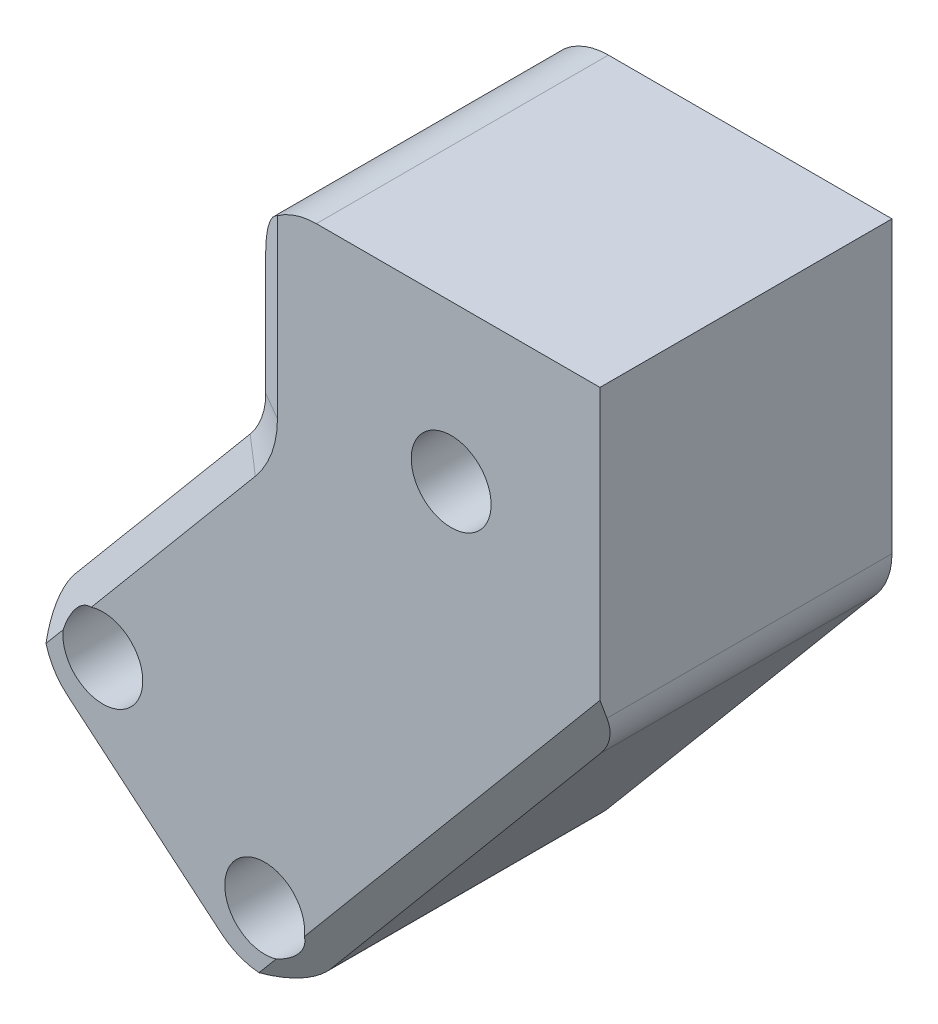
ISO-10303-21;
HEADER;
FILE_DESCRIPTION(('STEP AP214'),'2;1');
FILE_NAME('part.step','',(''),(''),'','','');
FILE_SCHEMA(('AUTOMOTIVE_DESIGN { 1 0 10303 214 1 1 1 1 }'));
ENDSEC;
DATA;
#1=APPLICATION_CONTEXT('core data for automotive mechanical design processes');
#2=APPLICATION_PROTOCOL_DEFINITION('international standard','automotive_design',2000,#1);
#3=PRODUCT_CONTEXT('',#1,'mechanical');
#4=PRODUCT('Part','Part','',(#3));
#5=PRODUCT_RELATED_PRODUCT_CATEGORY('part','',(#4));
#6=PRODUCT_DEFINITION_FORMATION('','',#4);
#7=PRODUCT_DEFINITION_CONTEXT('part definition',#1,'design');
#8=PRODUCT_DEFINITION('design','',#6,#7);
#9=PRODUCT_DEFINITION_SHAPE('','',#8);
#10=(LENGTH_UNIT() NAMED_UNIT(*) SI_UNIT(.MILLI.,.METRE.));
#11=(NAMED_UNIT(*) PLANE_ANGLE_UNIT() SI_UNIT($,.RADIAN.));
#12=(NAMED_UNIT(*) SI_UNIT($,.STERADIAN.) SOLID_ANGLE_UNIT());
#13=UNCERTAINTY_MEASURE_WITH_UNIT(LENGTH_MEASURE(1.E-05),#10,'distance_accuracy_value','');
#14=(GEOMETRIC_REPRESENTATION_CONTEXT(3) GLOBAL_UNCERTAINTY_ASSIGNED_CONTEXT((#13)) GLOBAL_UNIT_ASSIGNED_CONTEXT((#10,
#11,#12)) REPRESENTATION_CONTEXT('',''));
#15=CARTESIAN_POINT('',(0.,0.,0.));
#16=DIRECTION('',(0.,0.,1.));
#17=DIRECTION('',(1.,0.,0.));
#18=AXIS2_PLACEMENT_3D('',#15,#16,#17);
#19=CARTESIAN_POINT('',(-577.716152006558,-20.8198728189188,-31.75));
#20=DIRECTION('',(0.,0.,-1.));
#21=DIRECTION('',(-1.,0.,0.));
#22=AXIS2_PLACEMENT_3D('',#19,#20,#21);
#23=PLANE('',#22);
#24=CARTESIAN_POINT('',(-602.1057603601,-68.3480898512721,-31.7500000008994));
#25=DIRECTION('',(0.,0.,1.));
#26=DIRECTION('',(0.,-1.,0.));
#27=AXIS2_PLACEMENT_3D('',#24,#25,#26);
#28=CIRCLE('',#27,2.80669999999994);
#29=CARTESIAN_POINT('',(-602.1057603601,-71.154789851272,-31.7500000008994));
#30=VERTEX_POINT('',#29);
#31=EDGE_CURVE('E607',#30,#30,#28,.T.);
#32=ORIENTED_EDGE('',*,*,#31,.T.);
#33=EDGE_LOOP('',(#32));
#34=FACE_BOUND('',#33,.T.);
#35=CARTESIAN_POINT('',(-583.621107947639,-83.8585548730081,-31.7500000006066));
#36=DIRECTION('',(0.,0.,1.));
#37=DIRECTION('',(0.,-1.,0.));
#38=AXIS2_PLACEMENT_3D('',#35,#36,#37);
#39=CIRCLE('',#38,2.80669999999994);
#40=CARTESIAN_POINT('',(-583.621107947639,-86.6652548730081,-31.7500000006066));
#41=VERTEX_POINT('',#40);
#42=EDGE_CURVE('E632',#41,#41,#39,.T.);
#43=ORIENTED_EDGE('',*,*,#42,.T.);
#44=EDGE_LOOP('',(#43));
#45=FACE_BOUND('',#44,.T.);
#46=CARTESIAN_POINT('',(-577.716152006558,-20.8198728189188,-31.75));
#47=DIRECTION('',(0.,0.,1.));
#48=DIRECTION('',(-1.,0.,0.));
#49=AXIS2_PLACEMENT_3D('',#46,#47,#48);
#50=CIRCLE('',#49,7.61999999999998);
#51=CARTESIAN_POINT('',(-577.716152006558,-13.1998728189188,-31.75));
#52=VERTEX_POINT('',#51);
#53=CARTESIAN_POINT('',(-585.336152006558,-20.8198728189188,-31.75));
#54=VERTEX_POINT('',#53);
#55=EDGE_CURVE('E483',#52,#54,#50,.T.);
#56=ORIENTED_EDGE('',*,*,#55,.F.);
#57=DIRECTION('',(-1.,0.,0.));
#58=VECTOR('',#57,1.);
#59=CARTESIAN_POINT('',(-577.716152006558,-13.1998728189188,-31.75));
#60=LINE('',#59,#58);
#61=CARTESIAN_POINT('',(-545.331152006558,-13.1998728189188,-31.75));
#62=VERTEX_POINT('',#61);
#63=EDGE_CURVE('E521',#62,#52,#60,.T.);
#64=ORIENTED_EDGE('',*,*,#63,.F.);
#65=DIRECTION('',(0.,1.,0.));
#66=VECTOR('',#65,1.);
#67=CARTESIAN_POINT('',(-545.331152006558,-13.1998728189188,-31.75));
#68=LINE('',#67,#66);
#69=CARTESIAN_POINT('',(-545.331152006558,-46.319640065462,-31.75));
#70=VERTEX_POINT('',#69);
#71=EDGE_CURVE('E449',#70,#62,#68,.T.);
#72=ORIENTED_EDGE('',*,*,#71,.F.);
#73=CARTESIAN_POINT('',(-552.951152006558,-46.319640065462,-31.75));
#74=DIRECTION('',(0.,0.,1.));
#75=DIRECTION('',(1.,0.,0.));
#76=AXIS2_PLACEMENT_3D('',#73,#74,#75);
#77=CIRCLE('',#76,7.61999999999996);
#78=CARTESIAN_POINT('',(-547.113893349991,-51.2176816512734,-31.75));
#79=VERTEX_POINT('',#78);
#80=EDGE_CURVE('E515',#79,#70,#77,.T.);
#81=ORIENTED_EDGE('',*,*,#80,.F.);
#82=DIRECTION('',(0.642787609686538,0.766044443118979,0.));
#83=VECTOR('',#82,1.);
#84=CARTESIAN_POINT('',(-547.113893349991,-51.2176816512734,-31.75));
#85=LINE('',#84,#83);
#86=CARTESIAN_POINT('',(-577.862117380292,-87.8619881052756,-31.75));
#87=VERTEX_POINT('',#86);
#88=EDGE_CURVE('E511',#87,#79,#85,.T.);
#89=ORIENTED_EDGE('',*,*,#88,.F.);
#90=CARTESIAN_POINT('',(-583.699376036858,-82.9639465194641,-31.75));
#91=DIRECTION('',(0.,0.,1.));
#92=DIRECTION('',(1.,0.,0.));
#93=AXIS2_PLACEMENT_3D('',#90,#91,#92);
#94=CIRCLE('',#93,7.62000000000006);
#95=CARTESIAN_POINT('',(-588.59741762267,-88.8012051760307,-31.75));
#96=VERTEX_POINT('',#95);
#97=EDGE_CURVE('E507',#96,#87,#94,.T.);
#98=ORIENTED_EDGE('',*,*,#97,.F.);
#99=DIRECTION('',(0.766044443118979,-0.642787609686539,0.));
#100=VECTOR('',#99,1.);
#101=CARTESIAN_POINT('',(-606.109193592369,-74.1070804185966,-31.75));
#102=LINE('',#101,#100);
#103=CARTESIAN_POINT('',(-606.109193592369,-74.1070804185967,-31.75));
#104=VERTEX_POINT('',#103);
#105=EDGE_CURVE('E503',#104,#96,#102,.T.);
#106=ORIENTED_EDGE('',*,*,#105,.F.);
#107=CARTESIAN_POINT('',(-601.211152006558,-68.26982176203,-31.75));
#108=DIRECTION('',(0.,0.,1.));
#109=DIRECTION('',(1.,0.,0.));
#110=AXIS2_PLACEMENT_3D('',#107,#108,#109);
#111=CIRCLE('',#110,7.62000000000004);
#112=CARTESIAN_POINT('',(-607.048410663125,-63.3717801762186,-31.75));
#113=VERTEX_POINT('',#112);
#114=EDGE_CURVE('E499',#113,#104,#111,.T.);
#115=ORIENTED_EDGE('',*,*,#114,.F.);
#116=DIRECTION('',(-0.642787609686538,-0.766044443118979,0.));
#117=VECTOR('',#116,1.);
#118=CARTESIAN_POINT('',(-587.118893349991,-39.6207063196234,-31.75));
#119=LINE('',#118,#117);
#120=CARTESIAN_POINT('',(-587.118893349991,-39.6207063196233,-31.75));
#121=VERTEX_POINT('',#120);
#122=EDGE_CURVE('E495',#121,#113,#119,.T.);
#123=ORIENTED_EDGE('',*,*,#122,.F.);
#124=CARTESIAN_POINT('',(-592.956152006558,-34.722664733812,-31.75));
#125=DIRECTION('',(0.,0.,-1.));
#126=DIRECTION('',(-1.,0.,0.));
#127=AXIS2_PLACEMENT_3D('',#124,#125,#126);
#128=CIRCLE('',#127,7.61999999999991);
#129=CARTESIAN_POINT('',(-585.336152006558,-34.722664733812,-31.75));
#130=VERTEX_POINT('',#129);
#131=EDGE_CURVE('E491',#130,#121,#128,.T.);
#132=ORIENTED_EDGE('',*,*,#131,.F.);
#133=DIRECTION('',(0.,-1.,0.));
#134=VECTOR('',#133,1.);
#135=CARTESIAN_POINT('',(-585.336152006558,-20.8198728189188,-31.75));
#136=LINE('',#135,#134);
#137=EDGE_CURVE('E487',#54,#130,#136,.T.);
#138=ORIENTED_EDGE('',*,*,#137,.F.);
#139=EDGE_LOOP('',(#56,#64,#72,#81,#89,#98,#106,#115,#123,#132,#138));
#140=FACE_BOUND('',#139,.T.);
#141=CARTESIAN_POINT('',(-562.323795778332,-31.0085922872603,-31.7500000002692));
#142=DIRECTION('',(0.,0.,1.));
#143=DIRECTION('',(0.,-1.,0.));
#144=AXIS2_PLACEMENT_3D('',#141,#142,#143);
#145=CIRCLE('',#144,2.80669999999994);
#146=CARTESIAN_POINT('',(-562.323795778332,-33.8152922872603,-31.7500000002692));
#147=VERTEX_POINT('',#146);
#148=EDGE_CURVE('E648',#147,#147,#145,.T.);
#149=ORIENTED_EDGE('',*,*,#148,.T.);
#150=EDGE_LOOP('',(#149));
#151=FACE_BOUND('',#150,.T.);
#152=ADVANCED_FACE('F313',(#34,#45,#140,#151),#23,.T.);
#153=CARTESIAN_POINT('',(-577.716152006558,-13.1998728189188,26.0096));
#154=DIRECTION('',(0.,-1.,0.));
#155=DIRECTION('',(1.,0.,0.));
#156=AXIS2_PLACEMENT_3D('',#153,#154,#155);
#157=PLANE('',#156);
#158=DIRECTION('',(-1.,0.,-1.58417609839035E-11));
#159=VECTOR('',#158,1.);
#160=CARTESIAN_POINT('',(-395.120080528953,-13.1998728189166,1.59986188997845));
#161=LINE('',#160,#159);
#162=CARTESIAN_POINT('',(-545.331152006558,-13.1998728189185,1.59986188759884));
#163=VERTEX_POINT('',#162);
#164=CARTESIAN_POINT('',(-577.716152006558,-13.1998728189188,1.59986188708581));
#165=VERTEX_POINT('',#164);
#166=EDGE_CURVE('E436',#163,#165,#161,.T.);
#167=ORIENTED_EDGE('',*,*,#166,.F.);
#168=DIRECTION('',(0.,0.,-1.));
#169=VECTOR('',#168,1.);
#170=CARTESIAN_POINT('',(-545.331152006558,-13.1998728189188,26.0096));
#171=LINE('',#170,#169);
#172=EDGE_CURVE('E446',#163,#62,#171,.T.);
#173=ORIENTED_EDGE('',*,*,#172,.T.);
#174=ORIENTED_EDGE('',*,*,#63,.T.);
#175=DIRECTION('',(0.,0.,-1.));
#176=VECTOR('',#175,1.);
#177=CARTESIAN_POINT('',(-577.716152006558,-13.1998728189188,26.0096));
#178=LINE('',#177,#176);
#179=EDGE_CURVE('E455',#165,#52,#178,.T.);
#180=ORIENTED_EDGE('',*,*,#179,.F.);
#181=EDGE_LOOP('',(#167,#173,#174,#180));
#182=FACE_BOUND('',#181,.T.);
#183=ADVANCED_FACE('F458',(#182),#157,.F.);
#184=CARTESIAN_POINT('',(-577.716152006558,-20.8198728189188,26.0096));
#185=DIRECTION('',(0.,0.,-1.));
#186=DIRECTION('',(-1.,0.,0.));
#187=AXIS2_PLACEMENT_3D('',#184,#185,#186);
#188=CYLINDRICAL_SURFACE('',#187,7.61999999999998);
#189=DIRECTION('',(0.,0.,-1.));
#190=VECTOR('',#189,1.);
#191=CARTESIAN_POINT('',(-585.336152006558,-20.8198728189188,26.0096));
#192=LINE('',#191,#190);
#193=CARTESIAN_POINT('',(-585.336152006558,-20.8198728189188,-0.233225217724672));
#194=VERTEX_POINT('',#193);
#195=EDGE_CURVE('E443',#194,#54,#192,.T.);
#196=ORIENTED_EDGE('',*,*,#195,.F.);
#197=CARTESIAN_POINT('',(-577.716152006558,-20.8198728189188,4.16618383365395));
#198=DIRECTION('',(-0.5000000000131,0.,0.866025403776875));
#199=DIRECTION('',(-0.866025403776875,0.,-0.5000000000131));
#200=AXIS2_PLACEMENT_3D('',#197,#198,#199);
#201=ELLIPSE('',#200,8.79881810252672,7.61999999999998);
#202=CARTESIAN_POINT('',(-582.16115200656,-14.6306584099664,1.59986188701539));
#203=VERTEX_POINT('',#202);
#204=EDGE_CURVE('E582',#194,#203,#201,.F.);
#205=ORIENTED_EDGE('',*,*,#204,.T.);
#206=CARTESIAN_POINT('',(-577.716152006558,-20.8198728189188,1.59986188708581));
#207=DIRECTION('',(-1.58417609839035E-11,0.,1.));
#208=DIRECTION('',(1.,0.,1.58417609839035E-11));
#209=AXIS2_PLACEMENT_3D('',#206,#207,#208);
#210=CIRCLE('',#209,7.61999999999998);
#211=EDGE_CURVE('E480',#165,#203,#210,.T.);
#212=ORIENTED_EDGE('',*,*,#211,.F.);
#213=ORIENTED_EDGE('',*,*,#179,.T.);
#214=ORIENTED_EDGE('',*,*,#55,.T.);
#215=EDGE_LOOP('',(#196,#205,#212,#213,#214));
#216=FACE_BOUND('',#215,.T.);
#217=ADVANCED_FACE('F682',(#216),#188,.T.);
#218=CARTESIAN_POINT('',(-585.336152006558,-20.8198728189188,26.0096));
#219=DIRECTION('',(1.,0.,0.));
#220=DIRECTION('',(0.,1.,0.));
#221=AXIS2_PLACEMENT_3D('',#218,#219,#220);
#222=PLANE('',#221);
#223=DIRECTION('',(0.,0.,-1.));
#224=VECTOR('',#223,1.);
#225=CARTESIAN_POINT('',(-585.336152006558,-34.722664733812,26.0096));
#226=LINE('',#225,#224);
#227=CARTESIAN_POINT('',(-585.336152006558,-34.722664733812,-0.233225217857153));
#228=VERTEX_POINT('',#227);
#229=EDGE_CURVE('E546',#228,#130,#226,.T.);
#230=ORIENTED_EDGE('',*,*,#229,.F.);
#231=DIRECTION('',(0.,1.,0.));
#232=VECTOR('',#231,1.);
#233=CARTESIAN_POINT('',(-585.336152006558,-20.8198728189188,-0.233225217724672));
#234=LINE('',#233,#232);
#235=EDGE_CURVE('E579',#228,#194,#234,.T.);
#236=ORIENTED_EDGE('',*,*,#235,.T.);
#237=ORIENTED_EDGE('',*,*,#195,.T.);
#238=ORIENTED_EDGE('',*,*,#137,.T.);
#239=EDGE_LOOP('',(#230,#236,#237,#238));
#240=FACE_BOUND('',#239,.T.);
#241=ADVANCED_FACE('F709',(#240),#222,.F.);
#242=CARTESIAN_POINT('',(-592.956152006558,-34.722664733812,26.0096));
#243=DIRECTION('',(0.,0.,-1.));
#244=DIRECTION('',(-1.,0.,0.));
#245=AXIS2_PLACEMENT_3D('',#242,#243,#244);
#246=CYLINDRICAL_SURFACE('',#245,7.61999999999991);
#247=DIRECTION('',(0.,0.,-1.));
#248=VECTOR('',#247,1.);
#249=CARTESIAN_POINT('',(-587.118893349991,-39.6207063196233,26.0096));
#250=LINE('',#249,#248);
#251=CARTESIAN_POINT('',(-587.118893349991,-39.6207063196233,-0.233225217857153));
#252=VERTEX_POINT('',#251);
#253=EDGE_CURVE('E543',#252,#121,#250,.T.);
#254=ORIENTED_EDGE('',*,*,#253,.F.);
#255=CARTESIAN_POINT('',(-592.956152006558,-34.722664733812,-0.233225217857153));
#256=DIRECTION('',(0.,0.,1.));
#257=DIRECTION('',(1.,0.,0.));
#258=AXIS2_PLACEMENT_3D('',#255,#256,#257);
#259=CIRCLE('',#258,7.61999999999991);
#260=EDGE_CURVE('E585',#252,#228,#259,.T.);
#261=ORIENTED_EDGE('',*,*,#260,.T.);
#262=ORIENTED_EDGE('',*,*,#229,.T.);
#263=ORIENTED_EDGE('',*,*,#131,.T.);
#264=EDGE_LOOP('',(#254,#261,#262,#263));
#265=FACE_BOUND('',#264,.T.);
#266=ADVANCED_FACE('F705',(#265),#246,.F.);
#267=CARTESIAN_POINT('',(-587.118893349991,-39.6207063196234,26.0096));
#268=DIRECTION('',(0.766044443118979,-0.642787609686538,0.));
#269=DIRECTION('',(0.642787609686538,0.766044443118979,0.));
#270=AXIS2_PLACEMENT_3D('',#267,#268,#269);
#271=PLANE('',#270);
#272=DIRECTION('',(0.,0.,-1.));
#273=VECTOR('',#272,1.);
#274=CARTESIAN_POINT('',(-607.048410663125,-63.3717801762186,26.0096));
#275=LINE('',#274,#273);
#276=CARTESIAN_POINT('',(-607.048410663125,-63.3717801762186,-0.233225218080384));
#277=VERTEX_POINT('',#276);
#278=EDGE_CURVE('E540',#277,#113,#275,.T.);
#279=ORIENTED_EDGE('',*,*,#278,.F.);
#280=DIRECTION('',(0.642787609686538,0.766044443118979,1.01829352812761E-11));
#281=VECTOR('',#280,1.);
#282=CARTESIAN_POINT('',(-587.118893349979,-39.620706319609,-0.233225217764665));
#283=LINE('',#282,#281);
#284=EDGE_CURVE('E576',#277,#252,#283,.T.);
#285=ORIENTED_EDGE('',*,*,#284,.T.);
#286=ORIENTED_EDGE('',*,*,#253,.T.);
#287=ORIENTED_EDGE('',*,*,#122,.T.);
#288=EDGE_LOOP('',(#279,#285,#286,#287));
#289=FACE_BOUND('',#288,.T.);
#290=ADVANCED_FACE('F701',(#289),#271,.F.);
#291=CARTESIAN_POINT('',(-601.211152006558,-68.26982176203,26.0096));
#292=DIRECTION('',(0.,0.,-1.));
#293=DIRECTION('',(-1.,0.,0.));
#294=AXIS2_PLACEMENT_3D('',#291,#292,#293);
#295=CYLINDRICAL_SURFACE('',#294,7.62000000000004);
#296=CARTESIAN_POINT('',(-601.211152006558,-68.26982176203,1.5998618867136));
#297=DIRECTION('',(-1.58417609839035E-11,0.,1.));
#298=DIRECTION('',(1.,0.,1.58417609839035E-11));
#299=AXIS2_PLACEMENT_3D('',#296,#297,#298);
#300=CIRCLE('',#299,7.62000000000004);
#301=CARTESIAN_POINT('',(-608.594569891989,-70.1538441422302,1.59986188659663));
#302=VERTEX_POINT('',#301);
#303=CARTESIAN_POINT('',(-606.109193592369,-74.1070804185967,1.59986188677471));
#304=VERTEX_POINT('',#303);
#305=EDGE_CURVE('E477',#302,#304,#300,.T.);
#306=ORIENTED_EDGE('',*,*,#305,.F.);
#307=CARTESIAN_POINT('',(-601.211152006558,-68.26982176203,4.16618383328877));
#308=DIRECTION('',(-0.383022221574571,0.321393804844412,0.866025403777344));
#309=DIRECTION('',(-0.663413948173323,0.556670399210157,-0.500000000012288));
#310=AXIS2_PLACEMENT_3D('',#307,#308,#309);
#311=ELLIPSE('',#310,8.79881810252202,7.62000000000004);
#312=EDGE_CURVE('E573',#302,#277,#311,.F.);
#313=ORIENTED_EDGE('',*,*,#312,.T.);
#314=ORIENTED_EDGE('',*,*,#278,.T.);
#315=ORIENTED_EDGE('',*,*,#114,.T.);
#316=DIRECTION('',(0.,0.,-1.));
#317=VECTOR('',#316,1.);
#318=CARTESIAN_POINT('',(-606.109193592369,-74.1070804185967,26.0096));
#319=LINE('',#318,#317);
#320=EDGE_CURVE('E537',#304,#104,#319,.T.);
#321=ORIENTED_EDGE('',*,*,#320,.F.);
#322=EDGE_LOOP('',(#306,#313,#314,#315,#321));
#323=FACE_BOUND('',#322,.T.);
#324=ADVANCED_FACE('F697',(#323),#295,.T.);
#325=CARTESIAN_POINT('',(-606.109193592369,-74.1070804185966,26.0096));
#326=DIRECTION('',(0.642787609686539,0.766044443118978,0.));
#327=DIRECTION('',(-0.766044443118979,0.642787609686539,0.));
#328=AXIS2_PLACEMENT_3D('',#325,#326,#327);
#329=PLANE('',#328);
#330=DIRECTION('',(0.766044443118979,-0.642787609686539,1.21354530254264E-11));
#331=VECTOR('',#330,1.);
#332=CARTESIAN_POINT('',(-606.109193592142,-74.107080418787,1.59986188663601));
#333=LINE('',#332,#331);
#334=CARTESIAN_POINT('',(-588.59741762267,-88.8012051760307,1.59986188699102));
#335=VERTEX_POINT('',#334);
#336=EDGE_CURVE('E467',#304,#335,#333,.T.);
#337=ORIENTED_EDGE('',*,*,#336,.F.);
#338=ORIENTED_EDGE('',*,*,#320,.T.);
#339=ORIENTED_EDGE('',*,*,#105,.T.);
#340=DIRECTION('',(0.,0.,-1.));
#341=VECTOR('',#340,1.);
#342=CARTESIAN_POINT('',(-588.59741762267,-88.8012051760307,26.0096));
#343=LINE('',#342,#341);
#344=EDGE_CURVE('E534',#335,#96,#343,.T.);
#345=ORIENTED_EDGE('',*,*,#344,.F.);
#346=EDGE_LOOP('',(#337,#338,#339,#345));
#347=FACE_BOUND('',#346,.T.);
#348=ADVANCED_FACE('F694',(#347),#329,.F.);
#349=CARTESIAN_POINT('',(-583.699376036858,-82.9639465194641,26.0096));
#350=DIRECTION('',(0.,0.,-1.));
#351=DIRECTION('',(-1.,0.,0.));
#352=AXIS2_PLACEMENT_3D('',#349,#350,#351);
#353=CYLINDRICAL_SURFACE('',#352,7.62000000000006);
#354=DIRECTION('',(0.,0.,-1.));
#355=VECTOR('',#354,1.);
#356=CARTESIAN_POINT('',(-577.862117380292,-87.8619881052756,26.0096));
#357=LINE('',#356,#355);
#358=CARTESIAN_POINT('',(-577.862117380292,-87.8619881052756,-0.233225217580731));
#359=VERTEX_POINT('',#358);
#360=EDGE_CURVE('E531',#359,#87,#357,.T.);
#361=ORIENTED_EDGE('',*,*,#360,.F.);
#362=CARTESIAN_POINT('',(-583.699376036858,-82.9639465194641,4.16618383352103));
#363=DIRECTION('',(0.383022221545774,-0.321393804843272,0.866025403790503));
#364=DIRECTION('',(0.663413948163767,-0.556670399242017,-0.499999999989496));
#365=AXIS2_PLACEMENT_3D('',#362,#363,#364);
#366=ELLIPSE('',#365,8.79881810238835,7.62000000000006);
#367=CARTESIAN_POINT('',(-584.272658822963,-90.5623507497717,1.59986188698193));
#368=VERTEX_POINT('',#367);
#369=EDGE_CURVE('E230',#359,#368,#366,.F.);
#370=ORIENTED_EDGE('',*,*,#369,.T.);
#371=CARTESIAN_POINT('',(-583.699376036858,-82.9639465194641,1.59986188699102));
#372=DIRECTION('',(-1.58417609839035E-11,0.,1.));
#373=DIRECTION('',(1.,0.,1.58417609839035E-11));
#374=AXIS2_PLACEMENT_3D('',#371,#372,#373);
#375=CIRCLE('',#374,7.62000000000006);
#376=EDGE_CURVE('E460',#335,#368,#375,.T.);
#377=ORIENTED_EDGE('',*,*,#376,.F.);
#378=ORIENTED_EDGE('',*,*,#344,.T.);
#379=ORIENTED_EDGE('',*,*,#97,.T.);
#380=EDGE_LOOP('',(#361,#370,#377,#378,#379));
#381=FACE_BOUND('',#380,.T.);
#382=ADVANCED_FACE('F691',(#381),#353,.T.);
#383=CARTESIAN_POINT('',(-547.113893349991,-51.2176816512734,26.0096));
#384=DIRECTION('',(-0.766044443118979,0.642787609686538,0.));
#385=DIRECTION('',(-0.642787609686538,-0.766044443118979,0.));
#386=AXIS2_PLACEMENT_3D('',#383,#384,#385);
#387=PLANE('',#386);
#388=DIRECTION('',(0.,0.,-1.));
#389=VECTOR('',#388,1.);
#390=CARTESIAN_POINT('',(-547.113893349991,-51.2176816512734,26.0096));
#391=LINE('',#390,#389);
#392=CARTESIAN_POINT('',(-547.113893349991,-51.2176816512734,-0.233225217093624));
#393=VERTEX_POINT('',#392);
#394=EDGE_CURVE('E528',#393,#79,#391,.T.);
#395=ORIENTED_EDGE('',*,*,#394,.F.);
#396=DIRECTION('',(-0.642787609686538,-0.766044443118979,-1.01829352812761E-11));
#397=VECTOR('',#396,1.);
#398=CARTESIAN_POINT('',(-577.86211738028,-87.8619881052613,-0.233225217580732));
#399=LINE('',#398,#397);
#400=EDGE_CURVE('E324',#393,#359,#399,.T.);
#401=ORIENTED_EDGE('',*,*,#400,.T.);
#402=ORIENTED_EDGE('',*,*,#360,.T.);
#403=ORIENTED_EDGE('',*,*,#88,.T.);
#404=EDGE_LOOP('',(#395,#401,#402,#403));
#405=FACE_BOUND('',#404,.T.);
#406=ADVANCED_FACE('F688',(#405),#387,.F.);
#407=CARTESIAN_POINT('',(-552.951152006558,-46.319640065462,26.0096));
#408=DIRECTION('',(0.,0.,-1.));
#409=DIRECTION('',(-1.,0.,0.));
#410=AXIS2_PLACEMENT_3D('',#407,#408,#409);
#411=CYLINDRICAL_SURFACE('',#410,7.61999999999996);
#412=DIRECTION('',(0.,0.,-1.));
#413=VECTOR('',#412,1.);
#414=CARTESIAN_POINT('',(-545.331152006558,-46.319640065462,26.0096));
#415=LINE('',#414,#413);
#416=CARTESIAN_POINT('',(-545.331152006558,-46.319640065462,0.796040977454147));
#417=VERTEX_POINT('',#416);
#418=EDGE_CURVE('E454',#417,#70,#415,.T.);
#419=ORIENTED_EDGE('',*,*,#418,.F.);
#420=CARTESIAN_POINT('',(-552.951152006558,-46.319640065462,4.16618383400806));
#421=DIRECTION('',(0.383022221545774,-0.321393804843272,0.866025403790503));
#422=DIRECTION('',(0.663413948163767,-0.556670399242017,-0.499999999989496));
#423=AXIS2_PLACEMENT_3D('',#420,#421,#422);
#424=ELLIPSE('',#423,8.79881810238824,7.61999999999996);
#425=EDGE_CURVE('E339',#417,#393,#424,.F.);
#426=ORIENTED_EDGE('',*,*,#425,.T.);
#427=ORIENTED_EDGE('',*,*,#394,.T.);
#428=ORIENTED_EDGE('',*,*,#80,.T.);
#429=EDGE_LOOP('',(#419,#426,#427,#428));
#430=FACE_BOUND('',#429,.T.);
#431=ADVANCED_FACE('F673',(#430),#411,.T.);
#432=CARTESIAN_POINT('',(-545.331152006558,-13.1998728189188,26.0096));
#433=DIRECTION('',(-1.,0.,0.));
#434=DIRECTION('',(0.,0.,1.));
#435=AXIS2_PLACEMENT_3D('',#432,#433,#434);
#436=PLANE('',#435);
#437=DIRECTION('',(0.,1.,0.));
#438=VECTOR('',#437,1.);
#439=CARTESIAN_POINT('',(-545.331152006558,-13.1998728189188,1.59986188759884));
#440=LINE('',#439,#438);
#441=CARTESIAN_POINT('',(-545.331152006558,-44.1536701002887,1.59986188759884));
#442=VERTEX_POINT('',#441);
#443=EDGE_CURVE('E429',#442,#163,#440,.T.);
#444=ORIENTED_EDGE('',*,*,#443,.F.);
#445=DIRECTION('',(0.,-0.93752161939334,-0.34792702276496));
#446=VECTOR('',#445,1.);
#447=CARTESIAN_POINT('',(-545.331152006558,36.8227725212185,31.6513209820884));
#448=LINE('',#447,#446);
#449=EDGE_CURVE('E591',#442,#417,#448,.T.);
#450=ORIENTED_EDGE('',*,*,#449,.T.);
#451=ORIENTED_EDGE('',*,*,#418,.T.);
#452=ORIENTED_EDGE('',*,*,#71,.T.);
#453=ORIENTED_EDGE('',*,*,#172,.F.);
#454=EDGE_LOOP('',(#444,#450,#451,#452,#453));
#455=FACE_BOUND('',#454,.T.);
#456=ADVANCED_FACE('F447',(#455),#436,.F.);
#457=CARTESIAN_POINT('',(-395.120080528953,-13.1998728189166,1.59986188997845));
#458=DIRECTION('',(-1.58417609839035E-11,0.,1.));
#459=DIRECTION('',(1.,0.,1.58417609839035E-11));
#460=AXIS2_PLACEMENT_3D('',#457,#458,#459);
#461=PLANE('',#460);
#462=CARTESIAN_POINT('',(-602.1057603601,-68.3480898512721,1.59986188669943));
#463=DIRECTION('',(0.,0.,1.));
#464=DIRECTION('',(0.,-1.,0.));
#465=AXIS2_PLACEMENT_3D('',#462,#463,#464);
#466=CIRCLE('',#465,4.55930000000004);
#467=CARTESIAN_POINT('',(-606.634071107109,-67.8174126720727,1.59986188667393));
#468=VERTEX_POINT('',#467);
#469=CARTESIAN_POINT('',(-603.41470826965,-63.9807254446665,1.59986188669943));
#470=VERTEX_POINT('',#469);
#471=EDGE_CURVE('E628',#468,#470,#466,.T.);
#472=ORIENTED_EDGE('',*,*,#471,.F.);
#473=DIRECTION('',(-0.642787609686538,-0.766044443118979,-1.01829352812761E-11));
#474=VECTOR('',#473,1.);
#475=CARTESIAN_POINT('',(-604.616219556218,-65.4126308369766,1.59986188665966));
#476=LINE('',#475,#474);
#477=EDGE_CURVE('E567',#468,#302,#476,.T.);
#478=ORIENTED_EDGE('',*,*,#477,.T.);
#479=ORIENTED_EDGE('',*,*,#305,.T.);
#480=ORIENTED_EDGE('',*,*,#336,.T.);
#481=ORIENTED_EDGE('',*,*,#376,.T.);
#482=DIRECTION('',(0.642787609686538,0.766044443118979,1.01829352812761E-11));
#483=VECTOR('',#482,1.);
#484=CARTESIAN_POINT('',(-549.546084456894,-49.1768309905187,1.59986188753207));
#485=LINE('',#484,#483);
#486=CARTESIAN_POINT('',(-582.31216003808,-88.2259192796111,1.59986188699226));
#487=VERTEX_POINT('',#486);
#488=EDGE_CURVE('E553',#368,#487,#485,.T.);
#489=ORIENTED_EDGE('',*,*,#488,.T.);
#490=CARTESIAN_POINT('',(-583.621107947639,-83.8585548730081,1.59986188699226));
#491=DIRECTION('',(0.,0.,1.));
#492=DIRECTION('',(0.,-1.,0.));
#493=AXIS2_PLACEMENT_3D('',#490,#491,#492);
#494=CIRCLE('',#493,4.55930000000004);
#495=CARTESIAN_POINT('',(-579.092797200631,-84.3892320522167,1.59986188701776));
#496=VERTEX_POINT('',#495);
#497=EDGE_CURVE('E644',#496,#487,#494,.T.);
#498=ORIENTED_EDGE('',*,*,#497,.F.);
#499=DIRECTION('',(0.642787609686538,0.766044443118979,1.01829352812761E-11));
#500=VECTOR('',#499,1.);
#501=CARTESIAN_POINT('',(-549.546084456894,-49.1768309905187,1.59986188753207));
#502=LINE('',#501,#500);
#503=EDGE_CURVE('E439',#496,#442,#502,.T.);
#504=ORIENTED_EDGE('',*,*,#503,.T.);
#505=ORIENTED_EDGE('',*,*,#443,.T.);
#506=ORIENTED_EDGE('',*,*,#166,.T.);
#507=ORIENTED_EDGE('',*,*,#211,.T.);
#508=DIRECTION('',(0.,-1.,0.));
#509=VECTOR('',#508,1.);
#510=CARTESIAN_POINT('',(-582.16115200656,-34.722664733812,1.59986188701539));
#511=LINE('',#510,#509);
#512=CARTESIAN_POINT('',(-582.161152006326,-34.722664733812,1.59986188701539));
#513=VERTEX_POINT('',#512);
#514=EDGE_CURVE('E560',#203,#513,#511,.T.);
#515=ORIENTED_EDGE('',*,*,#514,.T.);
#516=CARTESIAN_POINT('',(-592.956152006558,-34.722664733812,1.59986188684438));
#517=DIRECTION('',(-1.58417609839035E-11,0.,1.));
#518=DIRECTION('',(1.,0.,1.58417609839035E-11));
#519=AXIS2_PLACEMENT_3D('',#516,#517,#518);
#520=CIRCLE('',#519,10.7950000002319);
#521=CARTESIAN_POINT('',(-584.686702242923,-41.6615569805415,1.59986188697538));
#522=VERTEX_POINT('',#521);
#523=EDGE_CURVE('E557',#513,#522,#520,.F.);
#524=ORIENTED_EDGE('',*,*,#523,.T.);
#525=DIRECTION('',(-0.642787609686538,-0.766044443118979,-1.01829352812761E-11));
#526=VECTOR('',#525,1.);
#527=CARTESIAN_POINT('',(-604.616219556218,-65.4126308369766,1.59986188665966));
#528=LINE('',#527,#526);
#529=EDGE_CURVE('E563',#522,#470,#528,.T.);
#530=ORIENTED_EDGE('',*,*,#529,.T.);
#531=EDGE_LOOP('',(#472,#478,#479,#480,#481,#489,#498,#504,#505,#506,#507,#515,#524,#530));
#532=FACE_BOUND('',#531,.T.);
#533=CARTESIAN_POINT('',(-562.323795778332,-31.0085922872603,1.59986188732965));
#534=DIRECTION('',(0.,0.,1.));
#535=DIRECTION('',(0.,-1.,0.));
#536=AXIS2_PLACEMENT_3D('',#533,#534,#535);
#537=CIRCLE('',#536,4.55930000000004);
#538=CARTESIAN_POINT('',(-562.323795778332,-35.5678922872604,1.59986188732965));
#539=VERTEX_POINT('',#538);
#540=EDGE_CURVE('E461',#539,#539,#537,.T.);
#541=ORIENTED_EDGE('',*,*,#540,.F.);
#542=EDGE_LOOP('',(#541));
#543=FACE_BOUND('',#542,.T.);
#544=ADVANCED_FACE('F432',(#532,#543),#461,.T.);
#545=CARTESIAN_POINT('',(-562.323795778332,-31.0085922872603,1.59986188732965));
#546=DIRECTION('',(0.,0.,1.));
#547=DIRECTION('',(0.,-1.,0.));
#548=AXIS2_PLACEMENT_3D('',#545,#546,#547);
#549=CYLINDRICAL_SURFACE('',#548,4.55930000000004);
#550=CARTESIAN_POINT('',(-562.323795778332,-31.0085922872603,-7.03613811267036));
#551=DIRECTION('',(0.,0.,1.));
#552=DIRECTION('',(0.,-1.,0.));
#553=AXIS2_PLACEMENT_3D('',#550,#551,#552);
#554=CIRCLE('',#553,4.55930000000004);
#555=CARTESIAN_POINT('',(-562.323795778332,-35.5678922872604,-7.03613811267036));
#556=VERTEX_POINT('',#555);
#557=EDGE_CURVE('E470',#556,#556,#554,.T.);
#558=ORIENTED_EDGE('',*,*,#557,.F.);
#559=EDGE_LOOP('',(#558));
#560=FACE_BOUND('',#559,.T.);
#561=ORIENTED_EDGE('',*,*,#540,.T.);
#562=EDGE_LOOP('',(#561));
#563=FACE_BOUND('',#562,.T.);
#564=ADVANCED_FACE('F662',(#560,#563),#549,.F.);
#565=CARTESIAN_POINT('',(-559.517095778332,-31.0085922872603,-7.03613811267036));
#566=DIRECTION('',(0.,0.,-1.));
#567=DIRECTION('',(0.,1.,0.));
#568=AXIS2_PLACEMENT_3D('',#565,#566,#567);
#569=PLANE('',#568);
#570=CARTESIAN_POINT('',(-562.323795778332,-31.0085922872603,-7.03613811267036));
#571=DIRECTION('',(0.,0.,1.));
#572=DIRECTION('',(0.,-1.,0.));
#573=AXIS2_PLACEMENT_3D('',#570,#571,#572);
#574=CIRCLE('',#573,2.80670000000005);
#575=CARTESIAN_POINT('',(-562.323795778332,-33.8152922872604,-7.03613811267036));
#576=VERTEX_POINT('',#575);
#577=EDGE_CURVE('E652',#576,#576,#574,.T.);
#578=ORIENTED_EDGE('',*,*,#577,.F.);
#579=EDGE_LOOP('',(#578));
#580=FACE_BOUND('',#579,.T.);
#581=ORIENTED_EDGE('',*,*,#557,.T.);
#582=EDGE_LOOP('',(#581));
#583=FACE_BOUND('',#582,.T.);
#584=ADVANCED_FACE('F660',(#580,#583),#569,.F.);
#585=CARTESIAN_POINT('',(-562.323795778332,-31.0085922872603,1.59986188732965));
#586=DIRECTION('',(0.,0.,1.));
#587=DIRECTION('',(0.,-1.,0.));
#588=AXIS2_PLACEMENT_3D('',#585,#586,#587);
#589=CYLINDRICAL_SURFACE('',#588,2.8067);
#590=ORIENTED_EDGE('',*,*,#148,.F.);
#591=EDGE_LOOP('',(#590));
#592=FACE_BOUND('',#591,.T.);
#593=ORIENTED_EDGE('',*,*,#577,.T.);
#594=EDGE_LOOP('',(#593));
#595=FACE_BOUND('',#594,.T.);
#596=ADVANCED_FACE('F769',(#592,#595),#589,.F.);
#597=CARTESIAN_POINT('',(-583.621107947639,-83.8585548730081,1.59986188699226));
#598=DIRECTION('',(0.,0.,1.));
#599=DIRECTION('',(0.,-1.,0.));
#600=AXIS2_PLACEMENT_3D('',#597,#598,#599);
#601=CYLINDRICAL_SURFACE('',#600,4.55930000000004);
#602=CARTESIAN_POINT('',(-583.621107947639,-83.8585548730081,-7.03613811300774));
#603=DIRECTION('',(0.,0.,1.));
#604=DIRECTION('',(0.,-1.,0.));
#605=AXIS2_PLACEMENT_3D('',#602,#603,#604);
#606=CIRCLE('',#605,4.55930000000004);
#607=CARTESIAN_POINT('',(-583.621107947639,-88.4178548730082,-7.03613811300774));
#608=VERTEX_POINT('',#607);
#609=EDGE_CURVE('E640',#608,#608,#606,.T.);
#610=ORIENTED_EDGE('',*,*,#609,.F.);
#611=EDGE_LOOP('',(#610));
#612=FACE_BOUND('',#611,.T.);
#613=ORIENTED_EDGE('',*,*,#497,.T.);
#614=CARTESIAN_POINT('',(-583.621107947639,-83.8585548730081,3.79956641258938));
#615=DIRECTION('',(0.383022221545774,-0.321393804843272,0.866025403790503));
#616=DIRECTION('',(-0.663413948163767,0.556670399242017,0.499999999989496));
#617=AXIS2_PLACEMENT_3D('',#614,#615,#616);
#618=ELLIPSE('',#617,5.2646261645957,4.55930000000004);
#619=EDGE_CURVE('E588',#487,#496,#618,.T.);
#620=ORIENTED_EDGE('',*,*,#619,.T.);
#621=EDGE_LOOP('',(#613,#620));
#622=FACE_BOUND('',#621,.T.);
#623=ADVANCED_FACE('F766',(#612,#622),#601,.F.);
#624=CARTESIAN_POINT('',(-580.814407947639,-83.8585548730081,-7.03613811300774));
#625=DIRECTION('',(0.,0.,-1.));
#626=DIRECTION('',(0.,1.,0.));
#627=AXIS2_PLACEMENT_3D('',#624,#625,#626);
#628=PLANE('',#627);
#629=CARTESIAN_POINT('',(-583.621107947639,-83.8585548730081,-7.03613811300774));
#630=DIRECTION('',(0.,0.,1.));
#631=DIRECTION('',(0.,-1.,0.));
#632=AXIS2_PLACEMENT_3D('',#629,#630,#631);
#633=CIRCLE('',#632,2.80670000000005);
#634=CARTESIAN_POINT('',(-583.621107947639,-86.6652548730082,-7.03613811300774));
#635=VERTEX_POINT('',#634);
#636=EDGE_CURVE('E636',#635,#635,#633,.T.);
#637=ORIENTED_EDGE('',*,*,#636,.F.);
#638=EDGE_LOOP('',(#637));
#639=FACE_BOUND('',#638,.T.);
#640=ORIENTED_EDGE('',*,*,#609,.T.);
#641=EDGE_LOOP('',(#640));
#642=FACE_BOUND('',#641,.T.);
#643=ADVANCED_FACE('F759',(#639,#642),#628,.F.);
#644=CARTESIAN_POINT('',(-583.621107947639,-83.8585548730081,1.59986188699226));
#645=DIRECTION('',(0.,0.,1.));
#646=DIRECTION('',(0.,-1.,0.));
#647=AXIS2_PLACEMENT_3D('',#644,#645,#646);
#648=CYLINDRICAL_SURFACE('',#647,2.8067);
#649=ORIENTED_EDGE('',*,*,#42,.F.);
#650=EDGE_LOOP('',(#649));
#651=FACE_BOUND('',#650,.T.);
#652=ORIENTED_EDGE('',*,*,#636,.T.);
#653=EDGE_LOOP('',(#652));
#654=FACE_BOUND('',#653,.T.);
#655=ADVANCED_FACE('F750',(#651,#654),#648,.F.);
#656=CARTESIAN_POINT('',(-602.1057603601,-68.3480898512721,1.59986188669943));
#657=DIRECTION('',(0.,0.,1.));
#658=DIRECTION('',(0.,-1.,0.));
#659=AXIS2_PLACEMENT_3D('',#656,#657,#658);
#660=CYLINDRICAL_SURFACE('',#659,4.55930000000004);
#661=CARTESIAN_POINT('',(-602.1057603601,-68.3480898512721,-7.03613811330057));
#662=DIRECTION('',(0.,0.,1.));
#663=DIRECTION('',(0.,-1.,0.));
#664=AXIS2_PLACEMENT_3D('',#661,#662,#663);
#665=CIRCLE('',#664,4.55930000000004);
#666=CARTESIAN_POINT('',(-602.1057603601,-72.9073898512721,-7.03613811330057));
#667=VERTEX_POINT('',#666);
#668=EDGE_CURVE('E622',#667,#667,#665,.T.);
#669=ORIENTED_EDGE('',*,*,#668,.F.);
#670=EDGE_LOOP('',(#669));
#671=FACE_BOUND('',#670,.T.);
#672=ORIENTED_EDGE('',*,*,#471,.T.);
#673=CARTESIAN_POINT('',(-602.1057603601,-68.3480898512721,3.79956641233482));
#674=DIRECTION('',(-0.383022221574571,0.321393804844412,0.866025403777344));
#675=DIRECTION('',(0.663413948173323,-0.556670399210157,0.500000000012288));
#676=AXIS2_PLACEMENT_3D('',#673,#674,#675);
#677=ELLIPSE('',#676,5.2646261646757,4.55930000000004);
#678=EDGE_CURVE('E570',#470,#468,#677,.T.);
#679=ORIENTED_EDGE('',*,*,#678,.T.);
#680=EDGE_LOOP('',(#672,#679));
#681=FACE_BOUND('',#680,.T.);
#682=ADVANCED_FACE('F748',(#671,#681),#660,.F.);
#683=CARTESIAN_POINT('',(-599.2990603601,-68.3480898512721,-7.03613811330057));
#684=DIRECTION('',(0.,0.,-1.));
#685=DIRECTION('',(0.,1.,0.));
#686=AXIS2_PLACEMENT_3D('',#683,#684,#685);
#687=PLANE('',#686);
#688=CARTESIAN_POINT('',(-602.1057603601,-68.3480898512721,-7.03613811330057));
#689=DIRECTION('',(0.,0.,1.));
#690=DIRECTION('',(0.,-1.,0.));
#691=AXIS2_PLACEMENT_3D('',#688,#689,#690);
#692=CIRCLE('',#691,2.80670000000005);
#693=CARTESIAN_POINT('',(-602.1057603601,-71.1547898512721,-7.03613811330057));
#694=VERTEX_POINT('',#693);
#695=EDGE_CURVE('E615',#694,#694,#692,.T.);
#696=ORIENTED_EDGE('',*,*,#695,.F.);
#697=EDGE_LOOP('',(#696));
#698=FACE_BOUND('',#697,.T.);
#699=ORIENTED_EDGE('',*,*,#668,.T.);
#700=EDGE_LOOP('',(#699));
#701=FACE_BOUND('',#700,.T.);
#702=ADVANCED_FACE('F739',(#698,#701),#687,.F.);
#703=CARTESIAN_POINT('',(-602.1057603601,-68.3480898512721,1.59986188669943));
#704=DIRECTION('',(0.,0.,1.));
#705=DIRECTION('',(0.,-1.,0.));
#706=AXIS2_PLACEMENT_3D('',#703,#704,#705);
#707=CYLINDRICAL_SURFACE('',#706,2.8067);
#708=ORIENTED_EDGE('',*,*,#31,.F.);
#709=EDGE_LOOP('',(#708));
#710=FACE_BOUND('',#709,.T.);
#711=ORIENTED_EDGE('',*,*,#695,.T.);
#712=EDGE_LOOP('',(#711));
#713=FACE_BOUND('',#712,.T.);
#714=ADVANCED_FACE('F733',(#710,#713),#707,.F.);
#715=CARTESIAN_POINT('',(-582.16115200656,-13.1998728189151,1.59986188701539));
#716=DIRECTION('',(-0.5000000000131,0.,0.866025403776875));
#717=DIRECTION('',(0.,1.,0.));
#718=AXIS2_PLACEMENT_3D('',#715,#716,#717);
#719=PLANE('',#718);
#720=ORIENTED_EDGE('',*,*,#204,.F.);
#721=ORIENTED_EDGE('',*,*,#235,.F.);
#722=DIRECTION('',(-0.866025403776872,0.,-0.500000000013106));
#723=VECTOR('',#722,1.);
#724=CARTESIAN_POINT('',(-582.16115200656,-34.722664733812,1.59986188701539));
#725=LINE('',#724,#723);
#726=EDGE_CURVE('E318',#513,#228,#725,.T.);
#727=ORIENTED_EDGE('',*,*,#726,.F.);
#728=ORIENTED_EDGE('',*,*,#514,.F.);
#729=EDGE_LOOP('',(#720,#721,#727,#728));
#730=FACE_BOUND('',#729,.T.);
#731=ADVANCED_FACE('F729',(#730),#719,.T.);
#732=CARTESIAN_POINT('',(-592.956152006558,-34.722664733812,1.59986188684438));
#733=DIRECTION('',(0.,0.,1.));
#734=DIRECTION('',(1.,0.,0.));
#735=AXIS2_PLACEMENT_3D('',#732,#733,#734);
#736=CONICAL_SURFACE('',#735,10.795000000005,1.04719755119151);
#737=ORIENTED_EDGE('',*,*,#726,.T.);
#738=ORIENTED_EDGE('',*,*,#260,.F.);
#739=DIRECTION('',(-0.663413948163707,0.556670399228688,-0.500000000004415));
#740=VECTOR('',#739,1.);
#741=CARTESIAN_POINT('',(-584.686702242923,-41.6615569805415,1.59986188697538));
#742=LINE('',#741,#740);
#743=EDGE_CURVE('E597',#522,#252,#742,.T.);
#744=ORIENTED_EDGE('',*,*,#743,.F.);
#745=ORIENTED_EDGE('',*,*,#523,.F.);
#746=EDGE_LOOP('',(#737,#738,#744,#745));
#747=FACE_BOUND('',#746,.T.);
#748=ADVANCED_FACE('F724',(#747),#736,.F.);
#749=CARTESIAN_POINT('',(-492.347696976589,68.3837842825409,1.5998618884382));
#750=DIRECTION('',(-0.383022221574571,0.321393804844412,0.866025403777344));
#751=DIRECTION('',(0.642787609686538,0.766044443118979,1.01829352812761E-11));
#752=AXIS2_PLACEMENT_3D('',#749,#750,#751);
#753=PLANE('',#752);
#754=ORIENTED_EDGE('',*,*,#743,.T.);
#755=ORIENTED_EDGE('',*,*,#284,.F.);
#756=ORIENTED_EDGE('',*,*,#312,.F.);
#757=ORIENTED_EDGE('',*,*,#477,.F.);
#758=ORIENTED_EDGE('',*,*,#678,.F.);
#759=ORIENTED_EDGE('',*,*,#529,.F.);
#760=EDGE_LOOP('',(#754,#755,#756,#757,#758,#759));
#761=FACE_BOUND('',#760,.T.);
#762=ADVANCED_FACE('F718',(#761),#753,.T.);
#763=CARTESIAN_POINT('',(-468.025785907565,47.9752776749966,1.5998618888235));
#764=DIRECTION('',(0.383022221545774,-0.321393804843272,0.866025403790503));
#765=DIRECTION('',(-0.642787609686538,-0.766044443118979,-1.01829352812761E-11));
#766=AXIS2_PLACEMENT_3D('',#763,#764,#765);
#767=PLANE('',#766);
#768=ORIENTED_EDGE('',*,*,#369,.F.);
#769=ORIENTED_EDGE('',*,*,#400,.F.);
#770=ORIENTED_EDGE('',*,*,#425,.F.);
#771=ORIENTED_EDGE('',*,*,#449,.F.);
#772=ORIENTED_EDGE('',*,*,#503,.F.);
#773=ORIENTED_EDGE('',*,*,#619,.F.);
#774=ORIENTED_EDGE('',*,*,#488,.F.);
#775=EDGE_LOOP('',(#768,#769,#770,#771,#772,#773,#774));
#776=FACE_BOUND('',#775,.T.);
#777=ADVANCED_FACE('F316',(#776),#767,.T.);
#778=CLOSED_SHELL('',(#152,#183,#217,#241,#266,#290,#324,#348,#382,#406,#431,#456,#544,#564,
#584,#596,#623,#643,#655,#682,#702,#714,#731,#748,#762,#777));
#779=MANIFOLD_SOLID_BREP('B7',#778);
#780=ADVANCED_BREP_SHAPE_REPRESENTATION('',(#18,#779),#14);
#781=SHAPE_DEFINITION_REPRESENTATION(#9,#780);
ENDSEC;
END-ISO-10303-21;
